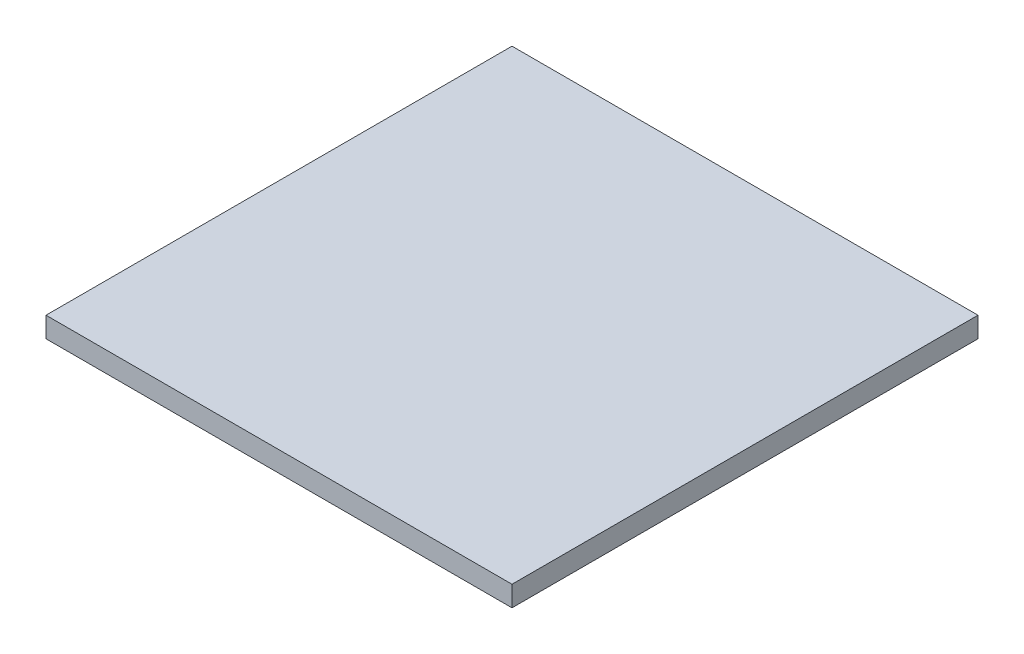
ISO-10303-21;
HEADER;
FILE_DESCRIPTION(('STEP AP214'),'2;1');
FILE_NAME('part.step','',(''),(''),'','','');
FILE_SCHEMA(('AUTOMOTIVE_DESIGN { 1 0 10303 214 1 1 1 1 }'));
ENDSEC;
DATA;
#1=APPLICATION_CONTEXT('core data for automotive mechanical design processes');
#2=APPLICATION_PROTOCOL_DEFINITION('international standard','automotive_design',2000,#1);
#3=PRODUCT_CONTEXT('',#1,'mechanical');
#4=PRODUCT('Part','Part','',(#3));
#5=PRODUCT_RELATED_PRODUCT_CATEGORY('part','',(#4));
#6=PRODUCT_DEFINITION_FORMATION('','',#4);
#7=PRODUCT_DEFINITION_CONTEXT('part definition',#1,'design');
#8=PRODUCT_DEFINITION('design','',#6,#7);
#9=PRODUCT_DEFINITION_SHAPE('','',#8);
#10=(LENGTH_UNIT() NAMED_UNIT(*) SI_UNIT(.MILLI.,.METRE.));
#11=(NAMED_UNIT(*) PLANE_ANGLE_UNIT() SI_UNIT($,.RADIAN.));
#12=(NAMED_UNIT(*) SI_UNIT($,.STERADIAN.) SOLID_ANGLE_UNIT());
#13=UNCERTAINTY_MEASURE_WITH_UNIT(LENGTH_MEASURE(1.E-05),#10,'distance_accuracy_value','');
#14=(GEOMETRIC_REPRESENTATION_CONTEXT(3) GLOBAL_UNCERTAINTY_ASSIGNED_CONTEXT((#13)) GLOBAL_UNIT_ASSIGNED_CONTEXT((#10,
#11,#12)) REPRESENTATION_CONTEXT('',''));
#15=CARTESIAN_POINT('',(0.,0.,0.));
#16=DIRECTION('',(0.,0.,1.));
#17=DIRECTION('',(1.,0.,0.));
#18=AXIS2_PLACEMENT_3D('',#15,#16,#17);
#19=CARTESIAN_POINT('',(57.,5.,-57.));
#20=DIRECTION('',(-1.,0.,0.));
#21=DIRECTION('',(0.,0.,1.));
#22=AXIS2_PLACEMENT_3D('',#19,#20,#21);
#23=PLANE('',#22);
#24=DIRECTION('',(0.,0.,-1.));
#25=VECTOR('',#24,1.);
#26=CARTESIAN_POINT('',(57.,0.,-57.));
#27=LINE('',#26,#25);
#28=CARTESIAN_POINT('',(57.,0.,57.));
#29=VERTEX_POINT('',#28);
#30=CARTESIAN_POINT('',(57.,0.,-57.));
#31=VERTEX_POINT('',#30);
#32=EDGE_CURVE('E100',#29,#31,#27,.T.);
#33=ORIENTED_EDGE('',*,*,#32,.T.);
#34=DIRECTION('',(0.,-1.,0.));
#35=VECTOR('',#34,1.);
#36=CARTESIAN_POINT('',(57.,5.,-57.));
#37=LINE('',#36,#35);
#38=CARTESIAN_POINT('',(57.,5.,-57.));
#39=VERTEX_POINT('',#38);
#40=EDGE_CURVE('E11',#39,#31,#37,.T.);
#41=ORIENTED_EDGE('',*,*,#40,.F.);
#42=DIRECTION('',(0.,0.,-1.));
#43=VECTOR('',#42,1.);
#44=CARTESIAN_POINT('',(57.,5.,-57.));
#45=LINE('',#44,#43);
#46=CARTESIAN_POINT('',(57.,5.,57.));
#47=VERTEX_POINT('',#46);
#48=EDGE_CURVE('E88',#47,#39,#45,.T.);
#49=ORIENTED_EDGE('',*,*,#48,.F.);
#50=DIRECTION('',(0.,-1.,0.));
#51=VECTOR('',#50,1.);
#52=CARTESIAN_POINT('',(57.,5.,57.));
#53=LINE('',#52,#51);
#54=EDGE_CURVE('E96',#47,#29,#53,.T.);
#55=ORIENTED_EDGE('',*,*,#54,.T.);
#56=EDGE_LOOP('',(#33,#41,#49,#55));
#57=FACE_BOUND('',#56,.T.);
#58=ADVANCED_FACE('F37',(#57),#23,.F.);
#59=CARTESIAN_POINT('',(-57.,5.,-57.));
#60=DIRECTION('',(0.,0.,1.));
#61=DIRECTION('',(1.,0.,0.));
#62=AXIS2_PLACEMENT_3D('',#59,#60,#61);
#63=PLANE('',#62);
#64=DIRECTION('',(-1.,0.,0.));
#65=VECTOR('',#64,1.);
#66=CARTESIAN_POINT('',(-57.,0.,-57.));
#67=LINE('',#66,#65);
#68=CARTESIAN_POINT('',(-57.,0.,-57.));
#69=VERTEX_POINT('',#68);
#70=EDGE_CURVE('E92',#31,#69,#67,.T.);
#71=ORIENTED_EDGE('',*,*,#70,.T.);
#72=DIRECTION('',(0.,-1.,0.));
#73=VECTOR('',#72,1.);
#74=CARTESIAN_POINT('',(-57.,5.,-57.));
#75=LINE('',#74,#73);
#76=CARTESIAN_POINT('',(-57.,5.,-57.));
#77=VERTEX_POINT('',#76);
#78=EDGE_CURVE('E45',#77,#69,#75,.T.);
#79=ORIENTED_EDGE('',*,*,#78,.F.);
#80=DIRECTION('',(-1.,0.,0.));
#81=VECTOR('',#80,1.);
#82=CARTESIAN_POINT('',(-57.,5.,-57.));
#83=LINE('',#82,#81);
#84=EDGE_CURVE('E83',#39,#77,#83,.T.);
#85=ORIENTED_EDGE('',*,*,#84,.F.);
#86=ORIENTED_EDGE('',*,*,#40,.T.);
#87=EDGE_LOOP('',(#71,#79,#85,#86));
#88=FACE_BOUND('',#87,.T.);
#89=ADVANCED_FACE('F91',(#88),#63,.F.);
#90=CARTESIAN_POINT('',(-57.,5.,-57.));
#91=DIRECTION('',(1.,0.,0.));
#92=DIRECTION('',(0.,0.,-1.));
#93=AXIS2_PLACEMENT_3D('',#90,#91,#92);
#94=PLANE('',#93);
#95=DIRECTION('',(0.,0.,1.));
#96=VECTOR('',#95,1.);
#97=CARTESIAN_POINT('',(-57.,0.,-57.));
#98=LINE('',#97,#96);
#99=CARTESIAN_POINT('',(-57.,0.,57.));
#100=VERTEX_POINT('',#99);
#101=EDGE_CURVE('E70',#69,#100,#98,.T.);
#102=ORIENTED_EDGE('',*,*,#101,.T.);
#103=DIRECTION('',(0.,-1.,0.));
#104=VECTOR('',#103,1.);
#105=CARTESIAN_POINT('',(-57.,5.,57.));
#106=LINE('',#105,#104);
#107=CARTESIAN_POINT('',(-57.,5.,57.));
#108=VERTEX_POINT('',#107);
#109=EDGE_CURVE('E93',#108,#100,#106,.T.);
#110=ORIENTED_EDGE('',*,*,#109,.F.);
#111=DIRECTION('',(0.,0.,1.));
#112=VECTOR('',#111,1.);
#113=CARTESIAN_POINT('',(-57.,5.,-57.));
#114=LINE('',#113,#112);
#115=EDGE_CURVE('E86',#77,#108,#114,.T.);
#116=ORIENTED_EDGE('',*,*,#115,.F.);
#117=ORIENTED_EDGE('',*,*,#78,.T.);
#118=EDGE_LOOP('',(#102,#110,#116,#117));
#119=FACE_BOUND('',#118,.T.);
#120=ADVANCED_FACE('F94',(#119),#94,.F.);
#121=CARTESIAN_POINT('',(-57.,5.,57.));
#122=DIRECTION('',(0.,0.,-1.));
#123=DIRECTION('',(-1.,0.,0.));
#124=AXIS2_PLACEMENT_3D('',#121,#122,#123);
#125=PLANE('',#124);
#126=DIRECTION('',(1.,0.,0.));
#127=VECTOR('',#126,1.);
#128=CARTESIAN_POINT('',(-57.,0.,57.));
#129=LINE('',#128,#127);
#130=EDGE_CURVE('E76',#100,#29,#129,.T.);
#131=ORIENTED_EDGE('',*,*,#130,.T.);
#132=ORIENTED_EDGE('',*,*,#54,.F.);
#133=DIRECTION('',(1.,0.,0.));
#134=VECTOR('',#133,1.);
#135=CARTESIAN_POINT('',(-57.,5.,57.));
#136=LINE('',#135,#134);
#137=EDGE_CURVE('E53',#108,#47,#136,.T.);
#138=ORIENTED_EDGE('',*,*,#137,.F.);
#139=ORIENTED_EDGE('',*,*,#109,.T.);
#140=EDGE_LOOP('',(#131,#132,#138,#139));
#141=FACE_BOUND('',#140,.T.);
#142=ADVANCED_FACE('F107',(#141),#125,.F.);
#143=CARTESIAN_POINT('',(0.,5.,0.));
#144=DIRECTION('',(0.,1.,0.));
#145=DIRECTION('',(0.,0.,1.));
#146=AXIS2_PLACEMENT_3D('',#143,#144,#145);
#147=PLANE('',#146);
#148=ORIENTED_EDGE('',*,*,#48,.T.);
#149=ORIENTED_EDGE('',*,*,#84,.T.);
#150=ORIENTED_EDGE('',*,*,#115,.T.);
#151=ORIENTED_EDGE('',*,*,#137,.T.);
#152=EDGE_LOOP('',(#148,#149,#150,#151));
#153=FACE_BOUND('',#152,.T.);
#154=ADVANCED_FACE('F84',(#153),#147,.T.);
#155=CARTESIAN_POINT('',(0.,0.,0.));
#156=DIRECTION('',(0.,1.,0.));
#157=DIRECTION('',(0.,0.,1.));
#158=AXIS2_PLACEMENT_3D('',#155,#156,#157);
#159=PLANE('',#158);
#160=ORIENTED_EDGE('',*,*,#32,.F.);
#161=ORIENTED_EDGE('',*,*,#130,.F.);
#162=ORIENTED_EDGE('',*,*,#101,.F.);
#163=ORIENTED_EDGE('',*,*,#70,.F.);
#164=EDGE_LOOP('',(#160,#161,#162,#163));
#165=FACE_BOUND('',#164,.T.);
#166=ADVANCED_FACE('F110',(#165),#159,.F.);
#167=CLOSED_SHELL('',(#58,#89,#120,#142,#154,#166));
#168=MANIFOLD_SOLID_BREP('B2',#167);
#169=ADVANCED_BREP_SHAPE_REPRESENTATION('',(#18,#168),#14);
#170=SHAPE_DEFINITION_REPRESENTATION(#9,#169);
ENDSEC;
END-ISO-10303-21;
